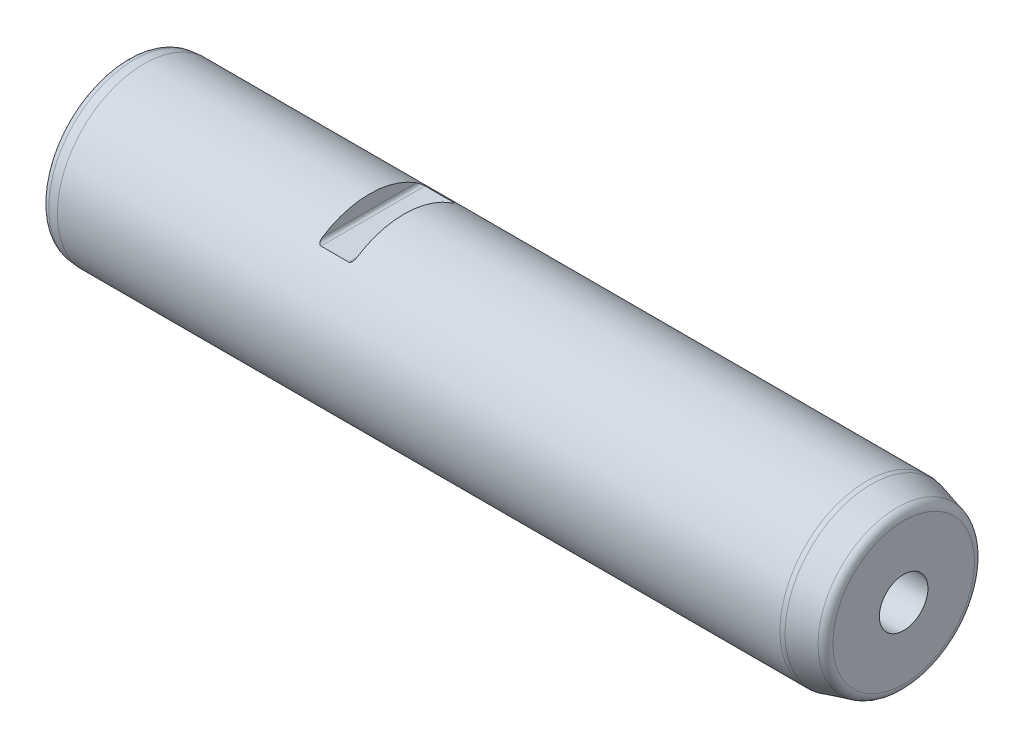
ISO-10303-21;
HEADER;
FILE_DESCRIPTION(('STEP AP214'),'2;1');
FILE_NAME('part.step','',(''),(''),'','','');
FILE_SCHEMA(('AUTOMOTIVE_DESIGN { 1 0 10303 214 1 1 1 1 }'));
ENDSEC;
DATA;
#1=APPLICATION_CONTEXT('core data for automotive mechanical design processes');
#2=APPLICATION_PROTOCOL_DEFINITION('international standard','automotive_design',2000,#1);
#3=PRODUCT_CONTEXT('',#1,'mechanical');
#4=PRODUCT('Part','Part','',(#3));
#5=PRODUCT_RELATED_PRODUCT_CATEGORY('part','',(#4));
#6=PRODUCT_DEFINITION_FORMATION('','',#4);
#7=PRODUCT_DEFINITION_CONTEXT('part definition',#1,'design');
#8=PRODUCT_DEFINITION('design','',#6,#7);
#9=PRODUCT_DEFINITION_SHAPE('','',#8);
#10=(LENGTH_UNIT() NAMED_UNIT(*) SI_UNIT(.MILLI.,.METRE.));
#11=(NAMED_UNIT(*) PLANE_ANGLE_UNIT() SI_UNIT($,.RADIAN.));
#12=(NAMED_UNIT(*) SI_UNIT($,.STERADIAN.) SOLID_ANGLE_UNIT());
#13=UNCERTAINTY_MEASURE_WITH_UNIT(LENGTH_MEASURE(1.E-05),#10,'distance_accuracy_value','');
#14=(GEOMETRIC_REPRESENTATION_CONTEXT(3) GLOBAL_UNCERTAINTY_ASSIGNED_CONTEXT((#13)) GLOBAL_UNIT_ASSIGNED_CONTEXT((#10,
#11,#12)) REPRESENTATION_CONTEXT('',''));
#15=CARTESIAN_POINT('',(0.,0.,0.));
#16=DIRECTION('',(0.,0.,1.));
#17=DIRECTION('',(1.,0.,0.));
#18=AXIS2_PLACEMENT_3D('',#15,#16,#17);
#19=CARTESIAN_POINT('',(0.,0.,0.));
#20=DIRECTION('',(1.,0.,0.));
#21=DIRECTION('',(0.,0.,-1.));
#22=AXIS2_PLACEMENT_3D('',#19,#20,#21);
#23=PLANE('',#22);
#24=CARTESIAN_POINT('',(0.,0.,0.));
#25=DIRECTION('',(1.,0.,0.));
#26=DIRECTION('',(0.,0.,-1.));
#27=AXIS2_PLACEMENT_3D('',#24,#25,#26);
#28=CIRCLE('',#27,22.2717287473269);
#29=CARTESIAN_POINT('',(0.,0.,-22.2717287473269));
#30=VERTEX_POINT('',#29);
#31=EDGE_CURVE('E160',#30,#30,#28,.F.);
#32=ORIENTED_EDGE('',*,*,#31,.T.);
#33=EDGE_LOOP('',(#32));
#34=FACE_BOUND('',#33,.T.);
#35=ADVANCED_FACE('F15',(#34),#23,.F.);
#36=CARTESIAN_POINT('',(0.,0.,0.));
#37=DIRECTION('',(-1.,0.,0.));
#38=DIRECTION('',(0.,0.,1.));
#39=AXIS2_PLACEMENT_3D('',#36,#37,#38);
#40=CYLINDRICAL_SURFACE('',#39,25.);
#41=CARTESIAN_POINT('',(79.,20.,-15.));
#42=CARTESIAN_POINT('',(79.0204326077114,19.9999962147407,-15.0000046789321));
#43=CARTESIAN_POINT('',(79.0408503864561,20.0006268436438,-14.99916423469));
#44=CARTESIAN_POINT('',(79.0814530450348,20.0031161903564,-14.9958444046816));
#45=CARTESIAN_POINT('',(79.1016381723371,20.0049734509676,-14.993366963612));
#46=CARTESIAN_POINT('',(79.1611193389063,20.0122659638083,-14.9836336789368));
#47=CARTESIAN_POINT('',(79.1998541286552,20.0194241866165,-14.9740740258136));
#48=CARTESIAN_POINT('',(79.274391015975,20.0376163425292,-14.9497209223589));
#49=CARTESIAN_POINT('',(79.3102051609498,20.048633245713,-14.9349504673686));
#50=CARTESIAN_POINT('',(79.378696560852,20.0737580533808,-14.9011638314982));
#51=CARTESIAN_POINT('',(79.411363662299,20.0878755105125,-14.8821345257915));
#52=CARTESIAN_POINT('',(79.4896711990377,20.1264955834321,-14.8298921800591));
#53=CARTESIAN_POINT('',(79.5330744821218,20.1525500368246,-14.7944897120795));
#54=CARTESIAN_POINT('',(79.6125432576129,20.2080720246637,-14.7185614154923));
#55=CARTESIAN_POINT('',(79.6485941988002,20.2375461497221,-14.6780256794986));
#56=CARTESIAN_POINT('',(79.707944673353,20.2928022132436,-14.6015056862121));
#57=CARTESIAN_POINT('',(79.7323659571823,20.3182250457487,-14.5661150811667));
#58=CARTESIAN_POINT('',(79.7773623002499,20.3700125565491,-14.4936048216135));
#59=CARTESIAN_POINT('',(79.7979348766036,20.3963778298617,-14.4564840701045));
#60=CARTESIAN_POINT('',(79.8545876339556,20.4765627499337,-14.3429056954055));
#61=CARTESIAN_POINT('',(79.8854357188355,20.5313064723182,-14.2644598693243));
#62=CARTESIAN_POINT('',(79.926216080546,20.6210933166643,-14.1341533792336));
#63=CARTESIAN_POINT('',(79.9396653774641,20.655945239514,-14.0831742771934));
#64=CARTESIAN_POINT('',(79.9623501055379,20.7257206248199,-13.9802847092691));
#65=CARTESIAN_POINT('',(79.9715835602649,20.760644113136,-13.9283738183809));
#66=CARTESIAN_POINT('',(79.986039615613,20.829829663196,-13.8246889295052));
#67=CARTESIAN_POINT('',(79.9913190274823,20.8640939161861,-13.7729240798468));
#68=CARTESIAN_POINT('',(79.9982907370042,20.9323059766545,-13.6690320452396));
#69=CARTESIAN_POINT('',(79.9999872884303,20.9662541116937,-13.6169053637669));
#70=CARTESIAN_POINT('',(80.,21.,-13.5646599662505));
#71=B_SPLINE_CURVE_WITH_KNOTS('',3,(#41,#42,#43,#44,#45,#46,#47,#48,#49,#50,#51,#52,#53,#54,#55,
#56,#57,#58,#59,#60,#61,#62,#63,#64,#65,#66,#67,#68,#69,#70),.UNSPECIFIED.,.F.,.F.,(4,2,2,2,2,2,
2,2,2,2,2,2,2,2,4),(0.,0.0612433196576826,0.122414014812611,0.243243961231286,0.363547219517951,
0.484226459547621,0.668512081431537,0.853158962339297,1.00280656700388,1.15255038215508,
1.45300909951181,1.64250050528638,1.83208065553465,2.01888173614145,2.20546091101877),.UNSPECIFIED.);
#72=CARTESIAN_POINT('',(79.,20.,-15.));
#73=VERTEX_POINT('',#72);
#74=CARTESIAN_POINT('',(80.,21.,-13.5646599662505));
#75=VERTEX_POINT('',#74);
#76=EDGE_CURVE('E206',#73,#75,#71,.T.);
#77=ORIENTED_EDGE('',*,*,#76,.T.);
#78=CARTESIAN_POINT('',(80.,0.,0.));
#79=DIRECTION('',(1.,0.,0.));
#80=DIRECTION('',(0.,0.,-1.));
#81=AXIS2_PLACEMENT_3D('',#78,#79,#80);
#82=CIRCLE('',#81,25.);
#83=CARTESIAN_POINT('',(80.,21.,13.5646599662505));
#84=VERTEX_POINT('',#83);
#85=EDGE_CURVE('E9',#75,#84,#82,.T.);
#86=ORIENTED_EDGE('',*,*,#85,.T.);
#87=CARTESIAN_POINT('',(80.,21.,13.5646599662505));
#88=CARTESIAN_POINT('',(79.999955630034,20.9542327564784,13.6355224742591));
#89=CARTESIAN_POINT('',(79.9968527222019,20.9080699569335,13.7061939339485));
#90=CARTESIAN_POINT('',(79.9838958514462,20.8150990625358,13.8469758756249));
#91=CARTESIAN_POINT('',(79.9740089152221,20.7682889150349,13.9170819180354));
#92=CARTESIAN_POINT('',(79.9467162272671,20.6742032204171,14.056474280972));
#93=CARTESIAN_POINT('',(79.929243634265,20.6269272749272,14.1257475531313));
#94=CARTESIAN_POINT('',(79.8857890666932,20.5330392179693,14.2618757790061));
#95=CARTESIAN_POINT('',(79.8598269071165,20.4864258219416,14.3287359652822));
#96=CARTESIAN_POINT('',(79.8073455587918,20.4086672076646,14.4391617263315));
#97=CARTESIAN_POINT('',(79.78337733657,20.3771135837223,14.4836486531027));
#98=CARTESIAN_POINT('',(79.7299895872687,20.3153235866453,14.5701902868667));
#99=CARTESIAN_POINT('',(79.7005747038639,20.2850861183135,14.6122470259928));
#100=CARTESIAN_POINT('',(79.6352592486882,20.2264422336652,14.6933167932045));
#101=CARTESIAN_POINT('',(79.5993032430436,20.1980545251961,14.7322993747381));
#102=CARTESIAN_POINT('',(79.5203001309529,20.1446922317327,14.8051816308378));
#103=CARTESIAN_POINT('',(79.4772638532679,20.1197125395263,14.8390889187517));
#104=CARTESIAN_POINT('',(79.399061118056,20.0824152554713,14.8895010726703));
#105=CARTESIAN_POINT('',(79.365934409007,20.0686302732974,14.908068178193));
#106=CARTESIAN_POINT('',(79.296557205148,20.0442807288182,14.9407906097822));
#107=CARTESIAN_POINT('',(79.2603170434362,20.0337060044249,14.9549598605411));
#108=CARTESIAN_POINT('',(79.1874516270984,20.0170610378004,14.9772311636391));
#109=CARTESIAN_POINT('',(79.150978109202,20.0107598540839,14.9856445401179));
#110=CARTESIAN_POINT('',(79.0951306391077,20.0043553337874,14.9941915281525));
#111=CARTESIAN_POINT('',(79.0762205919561,20.0027279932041,14.9963621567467));
#112=CARTESIAN_POINT('',(79.0382110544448,20.0005483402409,14.999268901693));
#113=CARTESIAN_POINT('',(79.0191113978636,19.9999970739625,15.0000036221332));
#114=CARTESIAN_POINT('',(79.,20.,15.));
#115=B_SPLINE_CURVE_WITH_KNOTS('',3,(#87,#88,#89,#90,#91,#92,#93,#94,#95,#96,#97,#98,#99,#100,
#101,#102,#103,#104,#105,#106,#107,#108,#109,#110,#111,#112,#113,#114),.UNSPECIFIED.,.F.,.F.,(4,
2,2,2,2,2,2,2,2,2,2,2,2,4),(0.,0.253099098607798,0.507437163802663,0.764063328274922,
1.02009474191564,1.19857022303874,1.37689423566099,1.55680656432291,1.73644624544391,
1.8572432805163,1.97765384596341,2.09088655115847,2.14812113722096,2.20541133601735),.UNSPECIFIED.);
#116=CARTESIAN_POINT('',(79.,20.,15.));
#117=VERTEX_POINT('',#116);
#118=EDGE_CURVE('E23',#84,#117,#115,.T.);
#119=ORIENTED_EDGE('',*,*,#118,.T.);
#120=DIRECTION('',(-1.,0.,0.));
#121=VECTOR('',#120,1.);
#122=CARTESIAN_POINT('',(0.,20.,15.));
#123=LINE('',#122,#121);
#124=CARTESIAN_POINT('',(71.,20.,15.));
#125=VERTEX_POINT('',#124);
#126=EDGE_CURVE('E74',#117,#125,#123,.T.);
#127=ORIENTED_EDGE('',*,*,#126,.T.);
#128=CARTESIAN_POINT('',(71.,20.,15.));
#129=CARTESIAN_POINT('',(70.9795673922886,19.9999962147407,15.0000046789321));
#130=CARTESIAN_POINT('',(70.9591496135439,20.0006268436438,14.99916423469));
#131=CARTESIAN_POINT('',(70.9185469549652,20.0031161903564,14.9958444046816));
#132=CARTESIAN_POINT('',(70.8983618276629,20.0049734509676,14.993366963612));
#133=CARTESIAN_POINT('',(70.8388806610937,20.0122659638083,14.9836336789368));
#134=CARTESIAN_POINT('',(70.8001458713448,20.0194241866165,14.9740740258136));
#135=CARTESIAN_POINT('',(70.725608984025,20.0376163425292,14.9497209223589));
#136=CARTESIAN_POINT('',(70.6897948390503,20.048633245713,14.9349504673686));
#137=CARTESIAN_POINT('',(70.6213034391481,20.0737580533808,14.9011638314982));
#138=CARTESIAN_POINT('',(70.5886363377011,20.0878755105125,14.8821345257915));
#139=CARTESIAN_POINT('',(70.5103288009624,20.1264955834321,14.8298921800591));
#140=CARTESIAN_POINT('',(70.4669255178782,20.1525500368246,14.7944897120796));
#141=CARTESIAN_POINT('',(70.3874567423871,20.2080720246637,14.7185614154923));
#142=CARTESIAN_POINT('',(70.3514058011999,20.2375461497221,14.6780256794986));
#143=CARTESIAN_POINT('',(70.292055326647,20.2928022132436,14.6015056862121));
#144=CARTESIAN_POINT('',(70.2676340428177,20.3182250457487,14.5661150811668));
#145=CARTESIAN_POINT('',(70.2226376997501,20.3700125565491,14.4936048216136));
#146=CARTESIAN_POINT('',(70.2020651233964,20.3963778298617,14.4564840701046));
#147=CARTESIAN_POINT('',(70.1454123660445,20.4765627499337,14.3429056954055));
#148=CARTESIAN_POINT('',(70.1145642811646,20.5313064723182,14.2644598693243));
#149=CARTESIAN_POINT('',(70.0737839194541,20.6210933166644,14.1341533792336));
#150=CARTESIAN_POINT('',(70.060334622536,20.655945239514,14.0831742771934));
#151=CARTESIAN_POINT('',(70.0376498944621,20.7257206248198,13.9802847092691));
#152=CARTESIAN_POINT('',(70.0284164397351,20.760644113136,13.9283738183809));
#153=CARTESIAN_POINT('',(70.013960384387,20.829829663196,13.8246889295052));
#154=CARTESIAN_POINT('',(70.0086809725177,20.8640939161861,13.7729240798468));
#155=CARTESIAN_POINT('',(70.0017092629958,20.9323059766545,13.6690320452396));
#156=CARTESIAN_POINT('',(70.0000127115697,20.9662541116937,13.6169053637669));
#157=CARTESIAN_POINT('',(70.,21.,13.5646599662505));
#158=B_SPLINE_CURVE_WITH_KNOTS('',3,(#128,#129,#130,#131,#132,#133,#134,#135,#136,#137,#138,
#139,#140,#141,#142,#143,#144,#145,#146,#147,#148,#149,#150,#151,#152,#153,#154,#155,#156,#157),
.UNSPECIFIED.,.F.,.F.,(4,2,2,2,2,2,2,2,2,2,2,2,2,2,4),(0.,0.0612433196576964,0.122414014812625,
0.243243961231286,0.363547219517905,0.484226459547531,0.668512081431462,0.853158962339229,
1.00280656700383,1.15255038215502,1.45300909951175,1.64250050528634,1.83208065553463,
2.01888173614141,2.20546091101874),.UNSPECIFIED.);
#159=CARTESIAN_POINT('',(70.,21.,13.5646599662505));
#160=VERTEX_POINT('',#159);
#161=EDGE_CURVE('E65',#125,#160,#158,.T.);
#162=ORIENTED_EDGE('',*,*,#161,.T.);
#163=CARTESIAN_POINT('',(70.,0.,0.));
#164=DIRECTION('',(-1.,0.,0.));
#165=DIRECTION('',(0.,-1.,0.));
#166=AXIS2_PLACEMENT_3D('',#163,#164,#165);
#167=CIRCLE('',#166,25.);
#168=CARTESIAN_POINT('',(70.,21.,-13.5646599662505));
#169=VERTEX_POINT('',#168);
#170=EDGE_CURVE('E54',#160,#169,#167,.T.);
#171=ORIENTED_EDGE('',*,*,#170,.T.);
#172=CARTESIAN_POINT('',(70.,21.,-13.5646599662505));
#173=CARTESIAN_POINT('',(70.000044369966,20.9542327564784,-13.6355224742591));
#174=CARTESIAN_POINT('',(70.0031472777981,20.9080699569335,-13.7061939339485));
#175=CARTESIAN_POINT('',(70.0161041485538,20.8150990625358,-13.846975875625));
#176=CARTESIAN_POINT('',(70.0259910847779,20.7682889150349,-13.9170819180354));
#177=CARTESIAN_POINT('',(70.0532837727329,20.674203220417,-14.0564742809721));
#178=CARTESIAN_POINT('',(70.070756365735,20.6269272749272,-14.1257475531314));
#179=CARTESIAN_POINT('',(70.1142109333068,20.5330392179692,-14.2618757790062));
#180=CARTESIAN_POINT('',(70.1401730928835,20.4864258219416,-14.3287359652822));
#181=CARTESIAN_POINT('',(70.1926544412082,20.4086672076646,-14.4391617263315));
#182=CARTESIAN_POINT('',(70.21662266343,20.3771135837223,-14.4836486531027));
#183=CARTESIAN_POINT('',(70.2700104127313,20.3153235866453,-14.5701902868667));
#184=CARTESIAN_POINT('',(70.2994252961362,20.2850861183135,-14.6122470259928));
#185=CARTESIAN_POINT('',(70.3647407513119,20.2264422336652,-14.6933167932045));
#186=CARTESIAN_POINT('',(70.4006967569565,20.1980545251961,-14.7322993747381));
#187=CARTESIAN_POINT('',(70.4796998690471,20.1446922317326,-14.8051816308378));
#188=CARTESIAN_POINT('',(70.5227361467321,20.1197125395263,-14.8390889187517));
#189=CARTESIAN_POINT('',(70.600938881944,20.0824152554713,-14.8895010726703));
#190=CARTESIAN_POINT('',(70.634065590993,20.0686302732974,-14.9080681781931));
#191=CARTESIAN_POINT('',(70.7034427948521,20.0442807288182,-14.9407906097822));
#192=CARTESIAN_POINT('',(70.7396829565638,20.0337060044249,-14.9549598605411));
#193=CARTESIAN_POINT('',(70.8125483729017,20.0170610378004,-14.9772311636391));
#194=CARTESIAN_POINT('',(70.8490218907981,20.0107598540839,-14.9856445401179));
#195=CARTESIAN_POINT('',(70.9048693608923,20.0043553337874,-14.9941915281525));
#196=CARTESIAN_POINT('',(70.9237794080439,20.0027279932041,-14.9963621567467));
#197=CARTESIAN_POINT('',(70.9617889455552,20.0005483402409,-14.999268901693));
#198=CARTESIAN_POINT('',(70.9808886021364,19.9999970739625,-15.0000036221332));
#199=CARTESIAN_POINT('',(71.,20.,-15.));
#200=B_SPLINE_CURVE_WITH_KNOTS('',3,(#172,#173,#174,#175,#176,#177,#178,#179,#180,#181,#182,
#183,#184,#185,#186,#187,#188,#189,#190,#191,#192,#193,#194,#195,#196,#197,#198,#199),
.UNSPECIFIED.,.F.,.F.,(4,2,2,2,2,2,2,2,2,2,2,2,2,4),(0.,0.253099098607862,0.507437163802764,
0.764063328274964,1.02009474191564,1.19857022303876,1.37689423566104,1.55680656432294,
1.7364462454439,1.85724328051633,1.97765384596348,2.09088655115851,2.14812113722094,
2.20541133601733),.UNSPECIFIED.);
#201=CARTESIAN_POINT('',(71.,20.,-15.));
#202=VERTEX_POINT('',#201);
#203=EDGE_CURVE('E59',#169,#202,#200,.T.);
#204=ORIENTED_EDGE('',*,*,#203,.T.);
#205=DIRECTION('',(-1.,0.,0.));
#206=VECTOR('',#205,1.);
#207=CARTESIAN_POINT('',(0.,20.,-15.));
#208=LINE('',#207,#206);
#209=EDGE_CURVE('E75',#202,#73,#208,.F.);
#210=ORIENTED_EDGE('',*,*,#209,.T.);
#211=EDGE_LOOP('',(#77,#86,#119,#127,#162,#171,#204,#210));
#212=FACE_BOUND('',#211,.T.);
#213=CARTESIAN_POINT('',(4.99999999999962,0.,0.));
#214=DIRECTION('',(1.,0.,0.));
#215=DIRECTION('',(0.,0.,-1.));
#216=AXIS2_PLACEMENT_3D('',#213,#214,#215);
#217=CIRCLE('',#216,25.);
#218=CARTESIAN_POINT('',(4.99999999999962,0.,-25.));
#219=VERTEX_POINT('',#218);
#220=EDGE_CURVE('E159',#219,#219,#217,.T.);
#221=ORIENTED_EDGE('',*,*,#220,.T.);
#222=EDGE_LOOP('',(#221));
#223=FACE_BOUND('',#222,.T.);
#224=CARTESIAN_POINT('',(213.341737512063,0.,0.));
#225=DIRECTION('',(1.,0.,0.));
#226=DIRECTION('',(0.,0.,-1.));
#227=AXIS2_PLACEMENT_3D('',#224,#225,#226);
#228=CIRCLE('',#227,25.);
#229=CARTESIAN_POINT('',(213.341737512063,0.,-25.));
#230=VERTEX_POINT('',#229);
#231=EDGE_CURVE('E177',#230,#230,#228,.F.);
#232=ORIENTED_EDGE('',*,*,#231,.T.);
#233=EDGE_LOOP('',(#232));
#234=FACE_BOUND('',#233,.T.);
#235=ADVANCED_FACE('F71',(#212,#223,#234),#40,.T.);
#236=CARTESIAN_POINT('',(224.,0.,0.));
#237=DIRECTION('',(-1.,0.,0.));
#238=DIRECTION('',(0.,0.,1.));
#239=AXIS2_PLACEMENT_3D('',#236,#237,#238);
#240=CONICAL_SURFACE('',#239,22.3205080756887,0.26179938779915);
#241=CARTESIAN_POINT('',(222.147047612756,0.,0.));
#242=DIRECTION('',(1.,0.,0.));
#243=DIRECTION('',(0.,0.,-1.));
#244=AXIS2_PLACEMENT_3D('',#241,#242,#243);
#245=CIRCLE('',#244,22.817005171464);
#246=CARTESIAN_POINT('',(222.147047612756,0.,-22.817005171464));
#247=VERTEX_POINT('',#246);
#248=EDGE_CURVE('E165',#247,#247,#245,.F.);
#249=ORIENTED_EDGE('',*,*,#248,.T.);
#250=EDGE_LOOP('',(#249));
#251=FACE_BOUND('',#250,.T.);
#252=CARTESIAN_POINT('',(214.635832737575,0.,0.));
#253=DIRECTION('',(1.,0.,0.));
#254=DIRECTION('',(0.,0.,-1.));
#255=AXIS2_PLACEMENT_3D('',#252,#253,#254);
#256=CIRCLE('',#255,24.8296291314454);
#257=CARTESIAN_POINT('',(214.635832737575,0.,-24.8296291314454));
#258=VERTEX_POINT('',#257);
#259=EDGE_CURVE('E190',#258,#258,#256,.T.);
#260=ORIENTED_EDGE('',*,*,#259,.T.);
#261=EDGE_LOOP('',(#260));
#262=FACE_BOUND('',#261,.T.);
#263=ADVANCED_FACE('F122',(#251,#262),#240,.T.);
#264=CARTESIAN_POINT('',(224.,22.3205080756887,0.));
#265=DIRECTION('',(-1.,0.,0.));
#266=DIRECTION('',(0.,0.,1.));
#267=AXIS2_PLACEMENT_3D('',#264,#265,#266);
#268=PLANE('',#267);
#269=CARTESIAN_POINT('',(224.,0.,0.));
#270=DIRECTION('',(1.,0.,0.));
#271=DIRECTION('',(0.,0.,-1.));
#272=AXIS2_PLACEMENT_3D('',#269,#270,#271);
#273=CIRCLE('',#272,7.);
#274=CARTESIAN_POINT('',(224.,0.,-7.));
#275=VERTEX_POINT('',#274);
#276=EDGE_CURVE('E180',#275,#275,#273,.T.);
#277=ORIENTED_EDGE('',*,*,#276,.F.);
#278=EDGE_LOOP('',(#277));
#279=FACE_BOUND('',#278,.T.);
#280=CARTESIAN_POINT('',(224.,0.,0.));
#281=DIRECTION('',(-1.,0.,0.));
#282=DIRECTION('',(0.,0.,1.));
#283=AXIS2_PLACEMENT_3D('',#280,#281,#282);
#284=CIRCLE('',#283,20.4021906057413);
#285=CARTESIAN_POINT('',(224.,0.,20.4021906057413));
#286=VERTEX_POINT('',#285);
#287=EDGE_CURVE('E161',#286,#286,#284,.F.);
#288=ORIENTED_EDGE('',*,*,#287,.T.);
#289=EDGE_LOOP('',(#288));
#290=FACE_BOUND('',#289,.T.);
#291=ADVANCED_FACE('F119',(#279,#290),#268,.F.);
#292=CARTESIAN_POINT('',(213.341737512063,0.,0.));
#293=DIRECTION('',(1.,0.,0.));
#294=DIRECTION('',(0.,0.,-1.));
#295=AXIS2_PLACEMENT_3D('',#292,#293,#294);
#296=TOROIDAL_SURFACE('',#295,20.,5.);
#297=ORIENTED_EDGE('',*,*,#259,.F.);
#298=EDGE_LOOP('',(#297));
#299=FACE_BOUND('',#298,.T.);
#300=ORIENTED_EDGE('',*,*,#231,.F.);
#301=EDGE_LOOP('',(#300));
#302=FACE_BOUND('',#301,.T.);
#303=ADVANCED_FACE('F121',(#299,#302),#296,.T.);
#304=CARTESIAN_POINT('',(221.5,0.,0.));
#305=DIRECTION('',(-1.,0.,0.));
#306=DIRECTION('',(0.,0.,1.));
#307=AXIS2_PLACEMENT_3D('',#304,#305,#306);
#308=TOROIDAL_SURFACE('',#307,20.4021906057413,2.5);
#309=ORIENTED_EDGE('',*,*,#287,.F.);
#310=EDGE_LOOP('',(#309));
#311=FACE_BOUND('',#310,.T.);
#312=ORIENTED_EDGE('',*,*,#248,.F.);
#313=EDGE_LOOP('',(#312));
#314=FACE_BOUND('',#313,.T.);
#315=ADVANCED_FACE('F142',(#311,#314),#308,.T.);
#316=CARTESIAN_POINT('',(0.,0.,0.));
#317=DIRECTION('',(1.,0.,0.));
#318=DIRECTION('',(0.,0.,-1.));
#319=AXIS2_PLACEMENT_3D('',#316,#317,#318);
#320=CONICAL_SURFACE('',#319,24.5625566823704,0.0872664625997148);
#321=CARTESIAN_POINT('',(2.28211064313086,0.,0.));
#322=DIRECTION('',(1.,0.,0.));
#323=DIRECTION('',(0.,0.,-1.));
#324=AXIS2_PLACEMENT_3D('',#321,#322,#323);
#325=CIRCLE('',#324,24.7622154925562);
#326=CARTESIAN_POINT('',(2.28211064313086,0.,-24.7622154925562));
#327=VERTEX_POINT('',#326);
#328=EDGE_CURVE('E60',#327,#327,#325,.T.);
#329=ORIENTED_EDGE('',*,*,#328,.T.);
#330=EDGE_LOOP('',(#329));
#331=FACE_BOUND('',#330,.T.);
#332=ORIENTED_EDGE('',*,*,#220,.F.);
#333=EDGE_LOOP('',(#332));
#334=FACE_BOUND('',#333,.T.);
#335=ADVANCED_FACE('F145',(#331,#334),#320,.T.);
#336=CARTESIAN_POINT('',(2.5,0.,0.));
#337=DIRECTION('',(1.,0.,0.));
#338=DIRECTION('',(0.,0.,-1.));
#339=AXIS2_PLACEMENT_3D('',#336,#337,#338);
#340=TOROIDAL_SURFACE('',#339,22.2717287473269,2.5);
#341=ORIENTED_EDGE('',*,*,#328,.F.);
#342=EDGE_LOOP('',(#341));
#343=FACE_BOUND('',#342,.T.);
#344=ORIENTED_EDGE('',*,*,#31,.F.);
#345=EDGE_LOOP('',(#344));
#346=FACE_BOUND('',#345,.T.);
#347=ADVANCED_FACE('F17',(#343,#346),#340,.T.);
#348=CARTESIAN_POINT('',(200.,0.,0.));
#349=DIRECTION('',(1.,0.,0.));
#350=DIRECTION('',(0.,0.,-1.));
#351=AXIS2_PLACEMENT_3D('',#348,#349,#350);
#352=PLANE('',#351);
#353=CARTESIAN_POINT('',(200.,0.,0.));
#354=DIRECTION('',(1.,0.,0.));
#355=DIRECTION('',(0.,0.,-1.));
#356=AXIS2_PLACEMENT_3D('',#353,#354,#355);
#357=CIRCLE('',#356,7.);
#358=CARTESIAN_POINT('',(200.,0.,-7.));
#359=VERTEX_POINT('',#358);
#360=EDGE_CURVE('E173',#359,#359,#357,.T.);
#361=ORIENTED_EDGE('',*,*,#360,.T.);
#362=EDGE_LOOP('',(#361));
#363=FACE_BOUND('',#362,.T.);
#364=CARTESIAN_POINT('',(200.,0.,0.));
#365=DIRECTION('',(1.,0.,0.));
#366=DIRECTION('',(0.,0.,-1.));
#367=AXIS2_PLACEMENT_3D('',#364,#365,#366);
#368=CIRCLE('',#367,5.1);
#369=CARTESIAN_POINT('',(200.,0.,-5.1));
#370=VERTEX_POINT('',#369);
#371=EDGE_CURVE('E170',#370,#370,#368,.F.);
#372=ORIENTED_EDGE('',*,*,#371,.T.);
#373=EDGE_LOOP('',(#372));
#374=FACE_BOUND('',#373,.T.);
#375=ADVANCED_FACE('F103',(#363,#374),#352,.T.);
#376=CARTESIAN_POINT('',(200.,0.,0.));
#377=DIRECTION('',(1.,0.,0.));
#378=DIRECTION('',(0.,0.,-1.));
#379=AXIS2_PLACEMENT_3D('',#376,#377,#378);
#380=CYLINDRICAL_SURFACE('',#379,7.);
#381=ORIENTED_EDGE('',*,*,#360,.F.);
#382=EDGE_LOOP('',(#381));
#383=FACE_BOUND('',#382,.T.);
#384=ORIENTED_EDGE('',*,*,#276,.T.);
#385=EDGE_LOOP('',(#384));
#386=FACE_BOUND('',#385,.T.);
#387=ADVANCED_FACE('F106',(#383,#386),#380,.F.);
#388=CARTESIAN_POINT('',(194.,0.,0.));
#389=DIRECTION('',(1.,0.,0.));
#390=DIRECTION('',(0.,0.,-1.));
#391=AXIS2_PLACEMENT_3D('',#388,#389,#390);
#392=CONICAL_SURFACE('',#391,5.1,1.0471975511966);
#393=CARTESIAN_POINT('',(191.055513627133,0.,0.));
#394=VERTEX_POINT('',#393);
#395=VERTEX_LOOP('',#394);
#396=FACE_BOUND('',#395,.T.);
#397=CARTESIAN_POINT('',(194.,0.,0.));
#398=DIRECTION('',(1.,0.,0.));
#399=DIRECTION('',(0.,0.,-1.));
#400=AXIS2_PLACEMENT_3D('',#397,#398,#399);
#401=CIRCLE('',#400,5.1);
#402=CARTESIAN_POINT('',(194.,0.,-5.1));
#403=VERTEX_POINT('',#402);
#404=EDGE_CURVE('E172',#403,#403,#401,.T.);
#405=ORIENTED_EDGE('',*,*,#404,.T.);
#406=EDGE_LOOP('',(#405));
#407=FACE_BOUND('',#406,.T.);
#408=ADVANCED_FACE('F110',(#396,#407),#392,.F.);
#409=CARTESIAN_POINT('',(224.,0.,0.));
#410=DIRECTION('',(1.,0.,0.));
#411=DIRECTION('',(0.,0.,-1.));
#412=AXIS2_PLACEMENT_3D('',#409,#410,#411);
#413=CYLINDRICAL_SURFACE('',#412,5.1);
#414=ORIENTED_EDGE('',*,*,#404,.F.);
#415=EDGE_LOOP('',(#414));
#416=FACE_BOUND('',#415,.T.);
#417=ORIENTED_EDGE('',*,*,#371,.F.);
#418=EDGE_LOOP('',(#417));
#419=FACE_BOUND('',#418,.T.);
#420=ADVANCED_FACE('F112',(#416,#419),#413,.F.);
#421=CARTESIAN_POINT('',(80.,21.,-25.));
#422=DIRECTION('',(1.,0.,0.));
#423=DIRECTION('',(0.,0.,-1.));
#424=AXIS2_PLACEMENT_3D('',#421,#422,#423);
#425=PLANE('',#424);
#426=DIRECTION('',(0.,0.,1.));
#427=VECTOR('',#426,1.);
#428=CARTESIAN_POINT('',(80.,21.,-25.));
#429=LINE('',#428,#427);
#430=EDGE_CURVE('E184',#75,#84,#429,.T.);
#431=ORIENTED_EDGE('',*,*,#430,.T.);
#432=ORIENTED_EDGE('',*,*,#85,.F.);
#433=EDGE_LOOP('',(#431,#432));
#434=FACE_BOUND('',#433,.T.);
#435=ADVANCED_FACE('F115',(#434),#425,.F.);
#436=CARTESIAN_POINT('',(79.,21.,-25.));
#437=DIRECTION('',(0.,0.,1.));
#438=DIRECTION('',(1.,0.,0.));
#439=AXIS2_PLACEMENT_3D('',#436,#437,#438);
#440=CYLINDRICAL_SURFACE('',#439,1.);
#441=ORIENTED_EDGE('',*,*,#430,.F.);
#442=ORIENTED_EDGE('',*,*,#76,.F.);
#443=DIRECTION('',(0.,0.,1.));
#444=VECTOR('',#443,1.);
#445=CARTESIAN_POINT('',(79.,20.,-25.));
#446=LINE('',#445,#444);
#447=EDGE_CURVE('E199',#73,#117,#446,.T.);
#448=ORIENTED_EDGE('',*,*,#447,.T.);
#449=ORIENTED_EDGE('',*,*,#118,.F.);
#450=EDGE_LOOP('',(#441,#442,#448,#449));
#451=FACE_BOUND('',#450,.T.);
#452=ADVANCED_FACE('F217',(#451),#440,.F.);
#453=CARTESIAN_POINT('',(71.,20.,-25.));
#454=DIRECTION('',(0.,-1.,0.));
#455=DIRECTION('',(0.,0.,-1.));
#456=AXIS2_PLACEMENT_3D('',#453,#454,#455);
#457=PLANE('',#456);
#458=ORIENTED_EDGE('',*,*,#447,.F.);
#459=ORIENTED_EDGE('',*,*,#209,.F.);
#460=DIRECTION('',(0.,0.,1.));
#461=VECTOR('',#460,1.);
#462=CARTESIAN_POINT('',(71.,20.,-25.));
#463=LINE('',#462,#461);
#464=EDGE_CURVE('E67',#202,#125,#463,.T.);
#465=ORIENTED_EDGE('',*,*,#464,.T.);
#466=ORIENTED_EDGE('',*,*,#126,.F.);
#467=EDGE_LOOP('',(#458,#459,#465,#466));
#468=FACE_BOUND('',#467,.T.);
#469=ADVANCED_FACE('F98',(#468),#457,.F.);
#470=CARTESIAN_POINT('',(71.,21.,-25.));
#471=DIRECTION('',(0.,0.,1.));
#472=DIRECTION('',(1.,0.,0.));
#473=AXIS2_PLACEMENT_3D('',#470,#471,#472);
#474=CYLINDRICAL_SURFACE('',#473,1.);
#475=ORIENTED_EDGE('',*,*,#464,.F.);
#476=ORIENTED_EDGE('',*,*,#203,.F.);
#477=DIRECTION('',(0.,0.,1.));
#478=VECTOR('',#477,1.);
#479=CARTESIAN_POINT('',(70.,21.,-25.));
#480=LINE('',#479,#478);
#481=EDGE_CURVE('E29',#169,#160,#480,.T.);
#482=ORIENTED_EDGE('',*,*,#481,.T.);
#483=ORIENTED_EDGE('',*,*,#161,.F.);
#484=EDGE_LOOP('',(#475,#476,#482,#483));
#485=FACE_BOUND('',#484,.T.);
#486=ADVANCED_FACE('F64',(#485),#474,.F.);
#487=CARTESIAN_POINT('',(70.,25.,-25.));
#488=DIRECTION('',(-1.,0.,0.));
#489=DIRECTION('',(0.,-1.,0.));
#490=AXIS2_PLACEMENT_3D('',#487,#488,#489);
#491=PLANE('',#490);
#492=ORIENTED_EDGE('',*,*,#481,.F.);
#493=ORIENTED_EDGE('',*,*,#170,.F.);
#494=EDGE_LOOP('',(#492,#493));
#495=FACE_BOUND('',#494,.T.);
#496=ADVANCED_FACE('F55',(#495),#491,.F.);
#497=CLOSED_SHELL('',(#35,#235,#263,#291,#303,#315,#335,#347,#375,#387,#408,#420,#435,#452,#469,
#486,#496));
#498=MANIFOLD_SOLID_BREP('B1',#497);
#499=ADVANCED_BREP_SHAPE_REPRESENTATION('',(#18,#498),#14);
#500=SHAPE_DEFINITION_REPRESENTATION(#9,#499);
ENDSEC;
END-ISO-10303-21;
